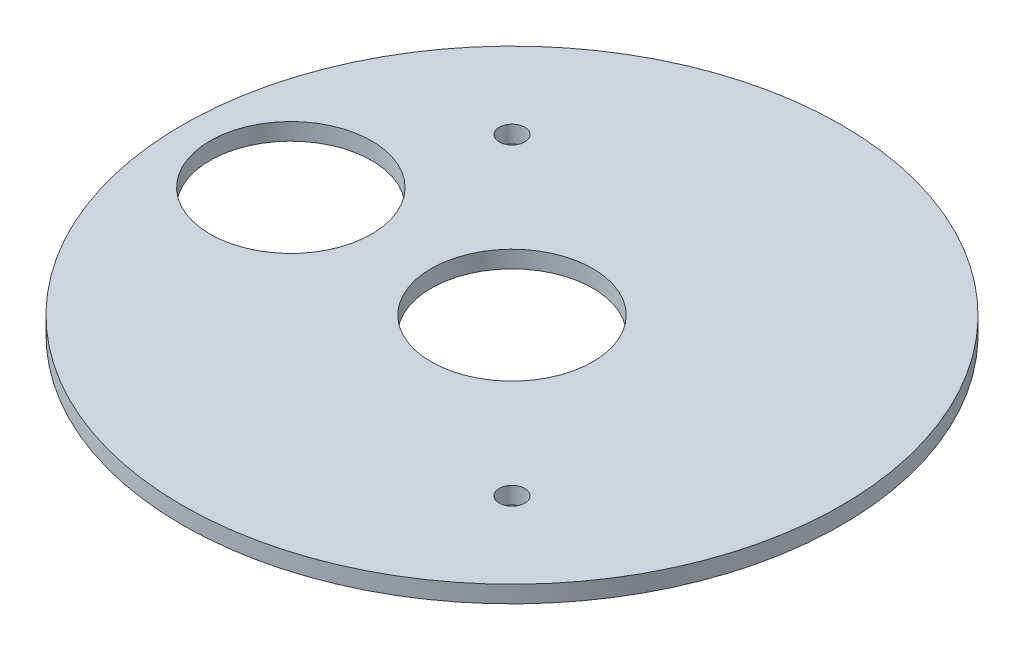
ISO-10303-21;
HEADER;
FILE_DESCRIPTION(('STEP AP214'),'2;1');
FILE_NAME('part.step','',(''),(''),'','','');
FILE_SCHEMA(('AUTOMOTIVE_DESIGN { 1 0 10303 214 1 1 1 1 }'));
ENDSEC;
DATA;
#1=APPLICATION_CONTEXT('core data for automotive mechanical design processes');
#2=APPLICATION_PROTOCOL_DEFINITION('international standard','automotive_design',2000,#1);
#3=PRODUCT_CONTEXT('',#1,'mechanical');
#4=PRODUCT('Part','Part','',(#3));
#5=PRODUCT_RELATED_PRODUCT_CATEGORY('part','',(#4));
#6=PRODUCT_DEFINITION_FORMATION('','',#4);
#7=PRODUCT_DEFINITION_CONTEXT('part definition',#1,'design');
#8=PRODUCT_DEFINITION('design','',#6,#7);
#9=PRODUCT_DEFINITION_SHAPE('','',#8);
#10=(LENGTH_UNIT() NAMED_UNIT(*) SI_UNIT(.MILLI.,.METRE.));
#11=(NAMED_UNIT(*) PLANE_ANGLE_UNIT() SI_UNIT($,.RADIAN.));
#12=(NAMED_UNIT(*) SI_UNIT($,.STERADIAN.) SOLID_ANGLE_UNIT());
#13=UNCERTAINTY_MEASURE_WITH_UNIT(LENGTH_MEASURE(1.E-05),#10,'distance_accuracy_value','');
#14=(GEOMETRIC_REPRESENTATION_CONTEXT(3) GLOBAL_UNCERTAINTY_ASSIGNED_CONTEXT((#13)) GLOBAL_UNIT_ASSIGNED_CONTEXT((#10,
#11,#12)) REPRESENTATION_CONTEXT('',''));
#15=CARTESIAN_POINT('',(0.,0.,0.));
#16=DIRECTION('',(0.,0.,1.));
#17=DIRECTION('',(1.,0.,0.));
#18=AXIS2_PLACEMENT_3D('',#15,#16,#17);
#19=CARTESIAN_POINT('',(0.,6.35,0.));
#20=DIRECTION('',(0.,-1.,0.));
#21=DIRECTION('',(0.,0.,-1.));
#22=AXIS2_PLACEMENT_3D('',#19,#20,#21);
#23=CYLINDRICAL_SURFACE('',#22,123.);
#24=CARTESIAN_POINT('',(0.,6.35,0.));
#25=DIRECTION('',(0.,1.,0.));
#26=DIRECTION('',(0.,0.,1.));
#27=AXIS2_PLACEMENT_3D('',#24,#25,#26);
#28=CIRCLE('',#27,123.);
#29=CARTESIAN_POINT('',(0.,6.35,123.));
#30=VERTEX_POINT('',#29);
#31=EDGE_CURVE('E10',#30,#30,#28,.T.);
#32=ORIENTED_EDGE('',*,*,#31,.F.);
#33=EDGE_LOOP('',(#32));
#34=FACE_BOUND('',#33,.T.);
#35=CARTESIAN_POINT('',(0.,0.,0.));
#36=DIRECTION('',(0.,1.,0.));
#37=DIRECTION('',(0.,0.,1.));
#38=AXIS2_PLACEMENT_3D('',#35,#36,#37);
#39=CIRCLE('',#38,123.);
#40=CARTESIAN_POINT('',(0.,0.,123.));
#41=VERTEX_POINT('',#40);
#42=EDGE_CURVE('E35',#41,#41,#39,.T.);
#43=ORIENTED_EDGE('',*,*,#42,.T.);
#44=EDGE_LOOP('',(#43));
#45=FACE_BOUND('',#44,.T.);
#46=ADVANCED_FACE('F32',(#34,#45),#23,.T.);
#47=CARTESIAN_POINT('',(0.,6.35,0.));
#48=DIRECTION('',(0.,1.,0.));
#49=DIRECTION('',(0.,0.,1.));
#50=AXIS2_PLACEMENT_3D('',#47,#48,#49);
#51=PLANE('',#50);
#52=CARTESIAN_POINT('',(-58.3716647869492,6.35,-58.3716647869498));
#53=DIRECTION('',(0.,1.,0.));
#54=DIRECTION('',(0.,0.,1.));
#55=AXIS2_PLACEMENT_3D('',#52,#53,#54);
#56=CIRCLE('',#55,4.7625);
#57=CARTESIAN_POINT('',(-58.3716647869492,6.35,-53.6091647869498));
#58=VERTEX_POINT('',#57);
#59=EDGE_CURVE('E69',#58,#58,#56,.T.);
#60=ORIENTED_EDGE('',*,*,#59,.F.);
#61=EDGE_LOOP('',(#60));
#62=FACE_BOUND('',#61,.T.);
#63=CARTESIAN_POINT('',(58.3716647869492,6.35,58.3716647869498));
#64=DIRECTION('',(0.,1.,0.));
#65=DIRECTION('',(0.,0.,1.));
#66=AXIS2_PLACEMENT_3D('',#63,#64,#65);
#67=CIRCLE('',#66,4.76249999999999);
#68=CARTESIAN_POINT('',(58.3716647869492,6.35,63.1341647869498));
#69=VERTEX_POINT('',#68);
#70=EDGE_CURVE('E62',#69,#69,#67,.T.);
#71=ORIENTED_EDGE('',*,*,#70,.F.);
#72=EDGE_LOOP('',(#71));
#73=FACE_BOUND('',#72,.T.);
#74=CARTESIAN_POINT('',(-82.55,6.35,0.));
#75=DIRECTION('',(0.,1.,0.));
#76=DIRECTION('',(0.,0.,1.));
#77=AXIS2_PLACEMENT_3D('',#74,#75,#76);
#78=CIRCLE('',#77,30.1625);
#79=CARTESIAN_POINT('',(-82.55,6.35,30.1625));
#80=VERTEX_POINT('',#79);
#81=EDGE_CURVE('E53',#80,#80,#78,.T.);
#82=ORIENTED_EDGE('',*,*,#81,.F.);
#83=EDGE_LOOP('',(#82));
#84=FACE_BOUND('',#83,.T.);
#85=CARTESIAN_POINT('',(0.,6.35,0.));
#86=DIRECTION('',(0.,1.,0.));
#87=DIRECTION('',(0.,0.,1.));
#88=AXIS2_PLACEMENT_3D('',#85,#86,#87);
#89=CIRCLE('',#88,30.1625);
#90=CARTESIAN_POINT('',(0.,6.35,30.1625));
#91=VERTEX_POINT('',#90);
#92=EDGE_CURVE('E47',#91,#91,#89,.T.);
#93=ORIENTED_EDGE('',*,*,#92,.F.);
#94=EDGE_LOOP('',(#93));
#95=FACE_BOUND('',#94,.T.);
#96=ORIENTED_EDGE('',*,*,#31,.T.);
#97=EDGE_LOOP('',(#96));
#98=FACE_BOUND('',#97,.T.);
#99=ADVANCED_FACE('F76',(#62,#73,#84,#95,#98),#51,.T.);
#100=CARTESIAN_POINT('',(0.,0.,0.));
#101=DIRECTION('',(0.,1.,0.));
#102=DIRECTION('',(0.,0.,1.));
#103=AXIS2_PLACEMENT_3D('',#100,#101,#102);
#104=PLANE('',#103);
#105=CARTESIAN_POINT('',(-58.3716647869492,0.,-58.3716647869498));
#106=DIRECTION('',(0.,1.,0.));
#107=DIRECTION('',(0.,0.,1.));
#108=AXIS2_PLACEMENT_3D('',#105,#106,#107);
#109=CIRCLE('',#108,4.7625);
#110=CARTESIAN_POINT('',(-58.3716647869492,0.,-53.6091647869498));
#111=VERTEX_POINT('',#110);
#112=EDGE_CURVE('E66',#111,#111,#109,.F.);
#113=ORIENTED_EDGE('',*,*,#112,.F.);
#114=EDGE_LOOP('',(#113));
#115=FACE_BOUND('',#114,.T.);
#116=CARTESIAN_POINT('',(58.3716647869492,0.,58.3716647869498));
#117=DIRECTION('',(0.,1.,0.));
#118=DIRECTION('',(0.,0.,1.));
#119=AXIS2_PLACEMENT_3D('',#116,#117,#118);
#120=CIRCLE('',#119,4.76249999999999);
#121=CARTESIAN_POINT('',(58.3716647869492,0.,63.1341647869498));
#122=VERTEX_POINT('',#121);
#123=EDGE_CURVE('E56',#122,#122,#120,.F.);
#124=ORIENTED_EDGE('',*,*,#123,.F.);
#125=EDGE_LOOP('',(#124));
#126=FACE_BOUND('',#125,.T.);
#127=CARTESIAN_POINT('',(-82.55,0.,0.));
#128=DIRECTION('',(0.,1.,0.));
#129=DIRECTION('',(0.,0.,1.));
#130=AXIS2_PLACEMENT_3D('',#127,#128,#129);
#131=CIRCLE('',#130,30.1625);
#132=CARTESIAN_POINT('',(-82.55,0.,30.1625));
#133=VERTEX_POINT('',#132);
#134=EDGE_CURVE('E50',#133,#133,#131,.T.);
#135=ORIENTED_EDGE('',*,*,#134,.T.);
#136=EDGE_LOOP('',(#135));
#137=FACE_BOUND('',#136,.T.);
#138=CARTESIAN_POINT('',(0.,0.,0.));
#139=DIRECTION('',(0.,1.,0.));
#140=DIRECTION('',(0.,0.,1.));
#141=AXIS2_PLACEMENT_3D('',#138,#139,#140);
#142=CIRCLE('',#141,30.1625);
#143=CARTESIAN_POINT('',(0.,0.,30.1625));
#144=VERTEX_POINT('',#143);
#145=EDGE_CURVE('E45',#144,#144,#142,.T.);
#146=ORIENTED_EDGE('',*,*,#145,.T.);
#147=EDGE_LOOP('',(#146));
#148=FACE_BOUND('',#147,.T.);
#149=ORIENTED_EDGE('',*,*,#42,.F.);
#150=EDGE_LOOP('',(#149));
#151=FACE_BOUND('',#150,.T.);
#152=ADVANCED_FACE('F79',(#115,#126,#137,#148,#151),#104,.F.);
#153=CARTESIAN_POINT('',(0.,0.,0.));
#154=DIRECTION('',(0.,1.,0.));
#155=DIRECTION('',(0.,0.,1.));
#156=AXIS2_PLACEMENT_3D('',#153,#154,#155);
#157=CYLINDRICAL_SURFACE('',#156,30.1625);
#158=ORIENTED_EDGE('',*,*,#145,.F.);
#159=EDGE_LOOP('',(#158));
#160=FACE_BOUND('',#159,.T.);
#161=ORIENTED_EDGE('',*,*,#92,.T.);
#162=EDGE_LOOP('',(#161));
#163=FACE_BOUND('',#162,.T.);
#164=ADVANCED_FACE('F87',(#160,#163),#157,.F.);
#165=CARTESIAN_POINT('',(-82.55,0.,0.));
#166=DIRECTION('',(0.,1.,0.));
#167=DIRECTION('',(0.,0.,1.));
#168=AXIS2_PLACEMENT_3D('',#165,#166,#167);
#169=CYLINDRICAL_SURFACE('',#168,30.1625);
#170=ORIENTED_EDGE('',*,*,#134,.F.);
#171=EDGE_LOOP('',(#170));
#172=FACE_BOUND('',#171,.T.);
#173=ORIENTED_EDGE('',*,*,#81,.T.);
#174=EDGE_LOOP('',(#173));
#175=FACE_BOUND('',#174,.T.);
#176=ADVANCED_FACE('F89',(#172,#175),#169,.F.);
#177=CARTESIAN_POINT('',(58.3716647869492,-0.00100000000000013,58.3716647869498));
#178=DIRECTION('',(0.,1.,0.));
#179=DIRECTION('',(0.,0.,1.));
#180=AXIS2_PLACEMENT_3D('',#177,#178,#179);
#181=CYLINDRICAL_SURFACE('',#180,4.76249999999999);
#182=ORIENTED_EDGE('',*,*,#70,.T.);
#183=EDGE_LOOP('',(#182));
#184=FACE_BOUND('',#183,.T.);
#185=ORIENTED_EDGE('',*,*,#123,.T.);
#186=EDGE_LOOP('',(#185));
#187=FACE_BOUND('',#186,.T.);
#188=ADVANCED_FACE('F96',(#184,#187),#181,.F.);
#189=CARTESIAN_POINT('',(-58.3716647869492,-0.00100000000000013,-58.3716647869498));
#190=DIRECTION('',(0.,1.,0.));
#191=DIRECTION('',(0.,0.,1.));
#192=AXIS2_PLACEMENT_3D('',#189,#190,#191);
#193=CYLINDRICAL_SURFACE('',#192,4.7625);
#194=ORIENTED_EDGE('',*,*,#59,.T.);
#195=EDGE_LOOP('',(#194));
#196=FACE_BOUND('',#195,.T.);
#197=ORIENTED_EDGE('',*,*,#112,.T.);
#198=EDGE_LOOP('',(#197));
#199=FACE_BOUND('',#198,.T.);
#200=ADVANCED_FACE('F73',(#196,#199),#193,.F.);
#201=CLOSED_SHELL('',(#46,#99,#152,#164,#176,#188,#200));
#202=MANIFOLD_SOLID_BREP('B2',#201);
#203=ADVANCED_BREP_SHAPE_REPRESENTATION('',(#18,#202),#14);
#204=SHAPE_DEFINITION_REPRESENTATION(#9,#203);
ENDSEC;
END-ISO-10303-21;
